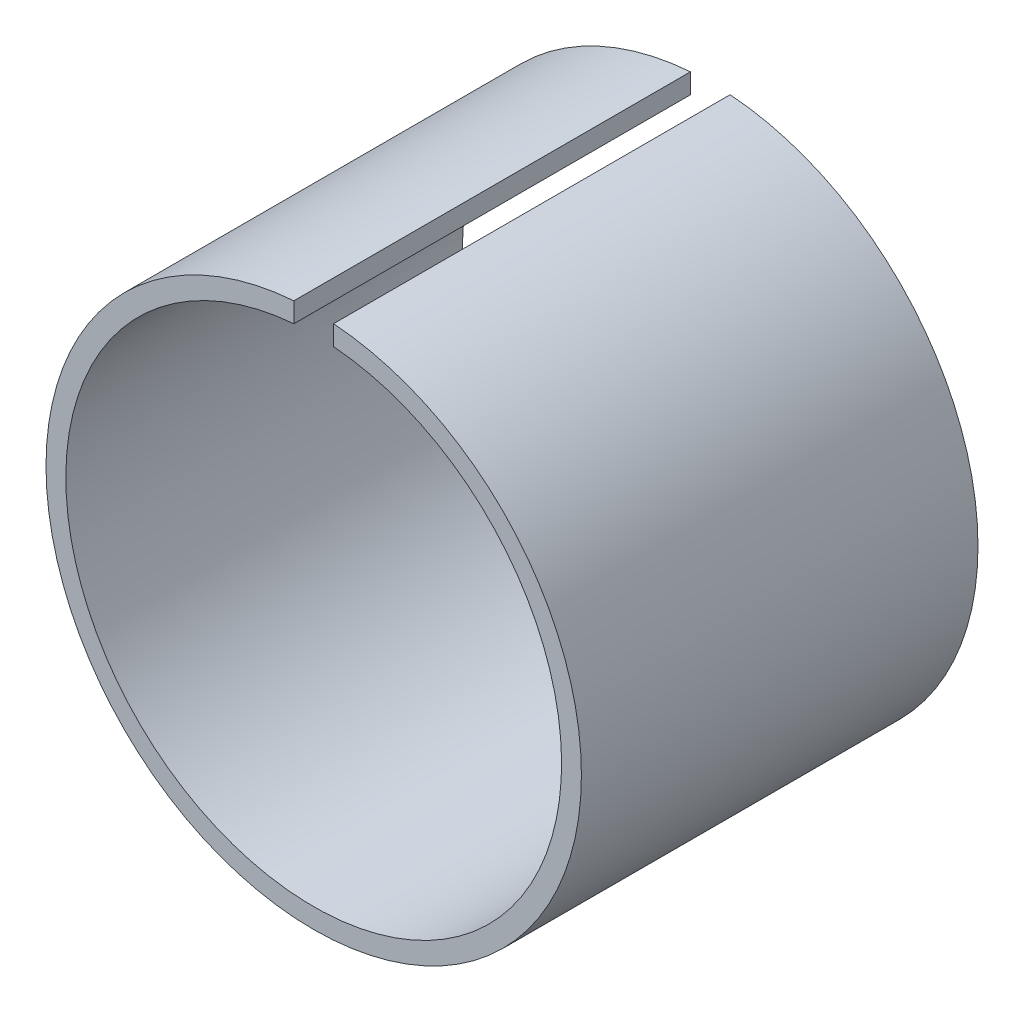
from build123d import *

# Parameters (mm, degrees)
EXTRUSION1_DEPTH = 20


with BuildPart() as part:
    # Esquisse1 → Extrusion1 (new body)
    with BuildSketch(Plane.XY):
        with BuildLine():
            Line((1, 13.462912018), (1, 12.459935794))
            ThreePointArc((1, 12.459935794), (0, -12.5), (-1, 12.459935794))
            Line((-1, 12.459935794), (-1, 13.462912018))
            ThreePointArc((-1, 13.462912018), (0, -13.5), (1, 13.462912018))
        make_face()
    extrude(amount=EXTRUSION1_DEPTH)


solid = part.part
